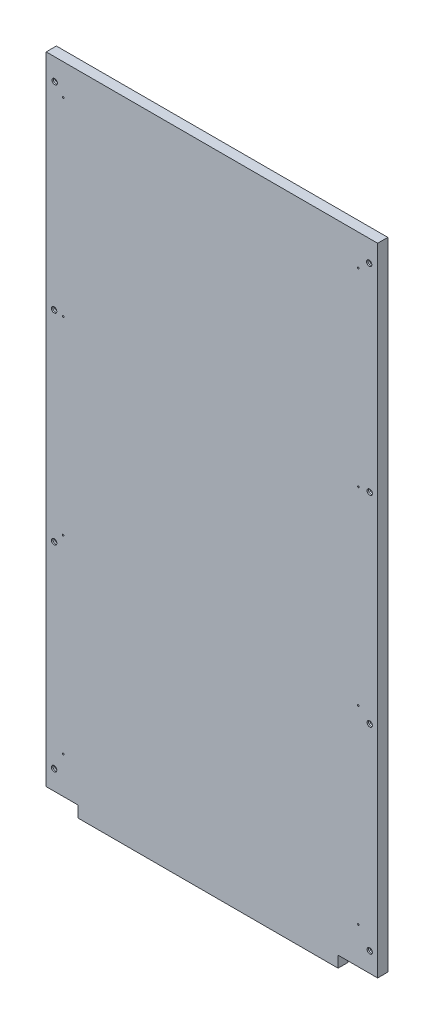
ISO-10303-21;
HEADER;
FILE_DESCRIPTION(('STEP AP214'),'2;1');
FILE_NAME('part.step','',(''),(''),'','','');
FILE_SCHEMA(('AUTOMOTIVE_DESIGN { 1 0 10303 214 1 1 1 1 }'));
ENDSEC;
DATA;
#1=APPLICATION_CONTEXT('core data for automotive mechanical design processes');
#2=APPLICATION_PROTOCOL_DEFINITION('international standard','automotive_design',2000,#1);
#3=PRODUCT_CONTEXT('',#1,'mechanical');
#4=PRODUCT('Part','Part','',(#3));
#5=PRODUCT_RELATED_PRODUCT_CATEGORY('part','',(#4));
#6=PRODUCT_DEFINITION_FORMATION('','',#4);
#7=PRODUCT_DEFINITION_CONTEXT('part definition',#1,'design');
#8=PRODUCT_DEFINITION('design','',#6,#7);
#9=PRODUCT_DEFINITION_SHAPE('','',#8);
#10=(LENGTH_UNIT() NAMED_UNIT(*) SI_UNIT(.MILLI.,.METRE.));
#11=(NAMED_UNIT(*) PLANE_ANGLE_UNIT() SI_UNIT($,.RADIAN.));
#12=(NAMED_UNIT(*) SI_UNIT($,.STERADIAN.) SOLID_ANGLE_UNIT());
#13=UNCERTAINTY_MEASURE_WITH_UNIT(LENGTH_MEASURE(1.E-05),#10,'distance_accuracy_value','');
#14=(GEOMETRIC_REPRESENTATION_CONTEXT(3) GLOBAL_UNCERTAINTY_ASSIGNED_CONTEXT((#13)) GLOBAL_UNIT_ASSIGNED_CONTEXT((#10,
#11,#12)) REPRESENTATION_CONTEXT('',''));
#15=CARTESIAN_POINT('',(0.,0.,0.));
#16=DIRECTION('',(0.,0.,1.));
#17=DIRECTION('',(1.,0.,0.));
#18=AXIS2_PLACEMENT_3D('',#15,#16,#17);
#19=CARTESIAN_POINT('',(-263.,496.922596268,3.));
#20=DIRECTION('',(0.,0.,-1.));
#21=DIRECTION('',(-1.,0.,0.));
#22=AXIS2_PLACEMENT_3D('',#19,#20,#21);
#23=PLANE('',#22);
#24=CARTESIAN_POINT('',(-263.,831.922596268,3.));
#25=DIRECTION('',(0.,0.,-1.));
#26=DIRECTION('',(-1.,0.,0.));
#27=AXIS2_PLACEMENT_3D('',#24,#25,#26);
#28=CIRCLE('',#27,1.5);
#29=CARTESIAN_POINT('',(-264.5,831.922596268,3.));
#30=VERTEX_POINT('',#29);
#31=EDGE_CURVE('E19',#30,#30,#28,.F.);
#32=ORIENTED_EDGE('',*,*,#31,.T.);
#33=EDGE_LOOP('',(#32));
#34=FACE_BOUND('',#33,.T.);
#35=ADVANCED_FACE('F16',(#34),#23,.F.);
#36=CARTESIAN_POINT('',(-263.,496.922596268,3.));
#37=DIRECTION('',(0.,0.,-1.));
#38=DIRECTION('',(-1.,0.,0.));
#39=AXIS2_PLACEMENT_3D('',#36,#37,#38);
#40=PLANE('',#39);
#41=CARTESIAN_POINT('',(-263.,496.922596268,3.));
#42=DIRECTION('',(0.,0.,-1.));
#43=DIRECTION('',(-1.,0.,0.));
#44=AXIS2_PLACEMENT_3D('',#41,#42,#43);
#45=CIRCLE('',#44,1.5);
#46=CARTESIAN_POINT('',(-264.5,496.922596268,3.));
#47=VERTEX_POINT('',#46);
#48=EDGE_CURVE('E240',#47,#47,#45,.F.);
#49=ORIENTED_EDGE('',*,*,#48,.T.);
#50=EDGE_LOOP('',(#49));
#51=FACE_BOUND('',#50,.T.);
#52=ADVANCED_FACE('F478',(#51),#40,.F.);
#53=CARTESIAN_POINT('',(-263.,496.922596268,3.));
#54=DIRECTION('',(0.,0.,-1.));
#55=DIRECTION('',(-1.,0.,0.));
#56=AXIS2_PLACEMENT_3D('',#53,#54,#55);
#57=PLANE('',#56);
#58=CARTESIAN_POINT('',(-263.,1166.92259627,3.));
#59=DIRECTION('',(0.,0.,-1.));
#60=DIRECTION('',(-1.,0.,0.));
#61=AXIS2_PLACEMENT_3D('',#58,#59,#60);
#62=CIRCLE('',#61,1.5);
#63=CARTESIAN_POINT('',(-264.5,1166.92259627,3.));
#64=VERTEX_POINT('',#63);
#65=EDGE_CURVE('E238',#64,#64,#62,.F.);
#66=ORIENTED_EDGE('',*,*,#65,.T.);
#67=EDGE_LOOP('',(#66));
#68=FACE_BOUND('',#67,.T.);
#69=ADVANCED_FACE('F475',(#68),#57,.F.);
#70=CARTESIAN_POINT('',(-263.,496.922596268,3.));
#71=DIRECTION('',(0.,0.,-1.));
#72=DIRECTION('',(-1.,0.,0.));
#73=AXIS2_PLACEMENT_3D('',#70,#71,#72);
#74=PLANE('',#73);
#75=CARTESIAN_POINT('',(-263.,1501.92259627,3.));
#76=DIRECTION('',(0.,0.,-1.));
#77=DIRECTION('',(-1.,0.,0.));
#78=AXIS2_PLACEMENT_3D('',#75,#76,#77);
#79=CIRCLE('',#78,1.5);
#80=CARTESIAN_POINT('',(-264.5,1501.92259627,3.));
#81=VERTEX_POINT('',#80);
#82=EDGE_CURVE('E235',#81,#81,#79,.F.);
#83=ORIENTED_EDGE('',*,*,#82,.T.);
#84=EDGE_LOOP('',(#83));
#85=FACE_BOUND('',#84,.T.);
#86=ADVANCED_FACE('F471',(#85),#74,.F.);
#87=CARTESIAN_POINT('',(-263.,496.922596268,3.));
#88=DIRECTION('',(0.,0.,-1.));
#89=DIRECTION('',(-1.,0.,0.));
#90=AXIS2_PLACEMENT_3D('',#87,#88,#89);
#91=PLANE('',#90);
#92=CARTESIAN_POINT('',(259.,496.922596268,3.));
#93=DIRECTION('',(0.,0.,-1.));
#94=DIRECTION('',(-1.,0.,0.));
#95=AXIS2_PLACEMENT_3D('',#92,#93,#94);
#96=CIRCLE('',#95,1.5);
#97=CARTESIAN_POINT('',(257.5,496.922596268,3.));
#98=VERTEX_POINT('',#97);
#99=EDGE_CURVE('E232',#98,#98,#96,.F.);
#100=ORIENTED_EDGE('',*,*,#99,.T.);
#101=EDGE_LOOP('',(#100));
#102=FACE_BOUND('',#101,.T.);
#103=ADVANCED_FACE('F467',(#102),#91,.F.);
#104=CARTESIAN_POINT('',(-263.,496.922596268,3.));
#105=DIRECTION('',(0.,0.,-1.));
#106=DIRECTION('',(-1.,0.,0.));
#107=AXIS2_PLACEMENT_3D('',#104,#105,#106);
#108=PLANE('',#107);
#109=CARTESIAN_POINT('',(259.,831.922596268,3.));
#110=DIRECTION('',(0.,0.,-1.));
#111=DIRECTION('',(-1.,0.,0.));
#112=AXIS2_PLACEMENT_3D('',#109,#110,#111);
#113=CIRCLE('',#112,1.5);
#114=CARTESIAN_POINT('',(257.5,831.922596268,3.));
#115=VERTEX_POINT('',#114);
#116=EDGE_CURVE('E229',#115,#115,#113,.F.);
#117=ORIENTED_EDGE('',*,*,#116,.T.);
#118=EDGE_LOOP('',(#117));
#119=FACE_BOUND('',#118,.T.);
#120=ADVANCED_FACE('F463',(#119),#108,.F.);
#121=CARTESIAN_POINT('',(-263.,496.922596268,3.));
#122=DIRECTION('',(0.,0.,-1.));
#123=DIRECTION('',(-1.,0.,0.));
#124=AXIS2_PLACEMENT_3D('',#121,#122,#123);
#125=PLANE('',#124);
#126=CARTESIAN_POINT('',(259.,1166.92259627,3.));
#127=DIRECTION('',(0.,0.,-1.));
#128=DIRECTION('',(-1.,0.,0.));
#129=AXIS2_PLACEMENT_3D('',#126,#127,#128);
#130=CIRCLE('',#129,1.5);
#131=CARTESIAN_POINT('',(257.5,1166.92259627,3.));
#132=VERTEX_POINT('',#131);
#133=EDGE_CURVE('E226',#132,#132,#130,.F.);
#134=ORIENTED_EDGE('',*,*,#133,.T.);
#135=EDGE_LOOP('',(#134));
#136=FACE_BOUND('',#135,.T.);
#137=ADVANCED_FACE('F459',(#136),#125,.F.);
#138=CARTESIAN_POINT('',(-263.,496.922596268,3.));
#139=DIRECTION('',(0.,0.,-1.));
#140=DIRECTION('',(-1.,0.,0.));
#141=AXIS2_PLACEMENT_3D('',#138,#139,#140);
#142=PLANE('',#141);
#143=CARTESIAN_POINT('',(259.,1501.92259627,3.));
#144=DIRECTION('',(0.,0.,-1.));
#145=DIRECTION('',(-1.,0.,0.));
#146=AXIS2_PLACEMENT_3D('',#143,#144,#145);
#147=CIRCLE('',#146,1.5);
#148=CARTESIAN_POINT('',(257.5,1501.92259627,3.));
#149=VERTEX_POINT('',#148);
#150=EDGE_CURVE('E223',#149,#149,#147,.F.);
#151=ORIENTED_EDGE('',*,*,#150,.T.);
#152=EDGE_LOOP('',(#151));
#153=FACE_BOUND('',#152,.T.);
#154=ADVANCED_FACE('F252',(#153),#142,.F.);
#155=CARTESIAN_POINT('',(-263.,831.922596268,17.9));
#156=DIRECTION('',(0.,0.,-1.));
#157=DIRECTION('',(-1.,0.,0.));
#158=AXIS2_PLACEMENT_3D('',#155,#156,#157);
#159=CYLINDRICAL_SURFACE('',#158,1.5);
#160=ORIENTED_EDGE('',*,*,#31,.F.);
#161=EDGE_LOOP('',(#160));
#162=FACE_BOUND('',#161,.T.);
#163=CARTESIAN_POINT('',(-263.,831.922596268,18.));
#164=DIRECTION('',(0.,0.,-1.));
#165=DIRECTION('',(-1.,0.,0.));
#166=AXIS2_PLACEMENT_3D('',#163,#164,#165);
#167=CIRCLE('',#166,1.5);
#168=CARTESIAN_POINT('',(-264.5,831.922596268,18.));
#169=VERTEX_POINT('',#168);
#170=EDGE_CURVE('E220',#169,#169,#167,.T.);
#171=ORIENTED_EDGE('',*,*,#170,.F.);
#172=EDGE_LOOP('',(#171));
#173=FACE_BOUND('',#172,.T.);
#174=ADVANCED_FACE('F248',(#162,#173),#159,.F.);
#175=CARTESIAN_POINT('',(-263.,496.922596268,17.9));
#176=DIRECTION('',(0.,0.,-1.));
#177=DIRECTION('',(-1.,0.,0.));
#178=AXIS2_PLACEMENT_3D('',#175,#176,#177);
#179=CYLINDRICAL_SURFACE('',#178,1.5);
#180=ORIENTED_EDGE('',*,*,#48,.F.);
#181=EDGE_LOOP('',(#180));
#182=FACE_BOUND('',#181,.T.);
#183=CARTESIAN_POINT('',(-263.,496.922596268,18.));
#184=DIRECTION('',(0.,0.,-1.));
#185=DIRECTION('',(-1.,0.,0.));
#186=AXIS2_PLACEMENT_3D('',#183,#184,#185);
#187=CIRCLE('',#186,1.5);
#188=CARTESIAN_POINT('',(-264.5,496.922596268,18.));
#189=VERTEX_POINT('',#188);
#190=EDGE_CURVE('E217',#189,#189,#187,.T.);
#191=ORIENTED_EDGE('',*,*,#190,.F.);
#192=EDGE_LOOP('',(#191));
#193=FACE_BOUND('',#192,.T.);
#194=ADVANCED_FACE('F251',(#182,#193),#179,.F.);
#195=CARTESIAN_POINT('',(-263.,1166.92259627,17.9));
#196=DIRECTION('',(0.,0.,-1.));
#197=DIRECTION('',(-1.,0.,0.));
#198=AXIS2_PLACEMENT_3D('',#195,#196,#197);
#199=CYLINDRICAL_SURFACE('',#198,1.5);
#200=ORIENTED_EDGE('',*,*,#65,.F.);
#201=EDGE_LOOP('',(#200));
#202=FACE_BOUND('',#201,.T.);
#203=CARTESIAN_POINT('',(-263.,1166.92259627,18.));
#204=DIRECTION('',(0.,0.,-1.));
#205=DIRECTION('',(-1.,0.,0.));
#206=AXIS2_PLACEMENT_3D('',#203,#204,#205);
#207=CIRCLE('',#206,1.5);
#208=CARTESIAN_POINT('',(-264.5,1166.92259627,18.));
#209=VERTEX_POINT('',#208);
#210=EDGE_CURVE('E190',#209,#209,#207,.T.);
#211=ORIENTED_EDGE('',*,*,#210,.F.);
#212=EDGE_LOOP('',(#211));
#213=FACE_BOUND('',#212,.T.);
#214=ADVANCED_FACE('F446',(#202,#213),#199,.F.);
#215=CARTESIAN_POINT('',(-263.,1501.92259627,17.9));
#216=DIRECTION('',(0.,0.,-1.));
#217=DIRECTION('',(-1.,0.,0.));
#218=AXIS2_PLACEMENT_3D('',#215,#216,#217);
#219=CYLINDRICAL_SURFACE('',#218,1.5);
#220=ORIENTED_EDGE('',*,*,#82,.F.);
#221=EDGE_LOOP('',(#220));
#222=FACE_BOUND('',#221,.T.);
#223=CARTESIAN_POINT('',(-263.,1501.92259627,18.));
#224=DIRECTION('',(0.,0.,-1.));
#225=DIRECTION('',(-1.,0.,0.));
#226=AXIS2_PLACEMENT_3D('',#223,#224,#225);
#227=CIRCLE('',#226,1.5);
#228=CARTESIAN_POINT('',(-264.5,1501.92259627,18.));
#229=VERTEX_POINT('',#228);
#230=EDGE_CURVE('E187',#229,#229,#227,.T.);
#231=ORIENTED_EDGE('',*,*,#230,.F.);
#232=EDGE_LOOP('',(#231));
#233=FACE_BOUND('',#232,.T.);
#234=ADVANCED_FACE('F452',(#222,#233),#219,.F.);
#235=CARTESIAN_POINT('',(259.,496.922596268,17.9));
#236=DIRECTION('',(0.,0.,-1.));
#237=DIRECTION('',(-1.,0.,0.));
#238=AXIS2_PLACEMENT_3D('',#235,#236,#237);
#239=CYLINDRICAL_SURFACE('',#238,1.5);
#240=ORIENTED_EDGE('',*,*,#99,.F.);
#241=EDGE_LOOP('',(#240));
#242=FACE_BOUND('',#241,.T.);
#243=CARTESIAN_POINT('',(259.,496.922596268,18.));
#244=DIRECTION('',(0.,0.,-1.));
#245=DIRECTION('',(-1.,0.,0.));
#246=AXIS2_PLACEMENT_3D('',#243,#244,#245);
#247=CIRCLE('',#246,1.5);
#248=CARTESIAN_POINT('',(257.5,496.922596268,18.));
#249=VERTEX_POINT('',#248);
#250=EDGE_CURVE('E184',#249,#249,#247,.T.);
#251=ORIENTED_EDGE('',*,*,#250,.F.);
#252=EDGE_LOOP('',(#251));
#253=FACE_BOUND('',#252,.T.);
#254=ADVANCED_FACE('F561',(#242,#253),#239,.F.);
#255=CARTESIAN_POINT('',(259.,831.922596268,17.9));
#256=DIRECTION('',(0.,0.,-1.));
#257=DIRECTION('',(-1.,0.,0.));
#258=AXIS2_PLACEMENT_3D('',#255,#256,#257);
#259=CYLINDRICAL_SURFACE('',#258,1.5);
#260=ORIENTED_EDGE('',*,*,#116,.F.);
#261=EDGE_LOOP('',(#260));
#262=FACE_BOUND('',#261,.T.);
#263=CARTESIAN_POINT('',(259.,831.922596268,18.));
#264=DIRECTION('',(0.,0.,-1.));
#265=DIRECTION('',(-1.,0.,0.));
#266=AXIS2_PLACEMENT_3D('',#263,#264,#265);
#267=CIRCLE('',#266,1.5);
#268=CARTESIAN_POINT('',(257.5,831.922596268,18.));
#269=VERTEX_POINT('',#268);
#270=EDGE_CURVE('E181',#269,#269,#267,.T.);
#271=ORIENTED_EDGE('',*,*,#270,.F.);
#272=EDGE_LOOP('',(#271));
#273=FACE_BOUND('',#272,.T.);
#274=ADVANCED_FACE('F570',(#262,#273),#259,.F.);
#275=CARTESIAN_POINT('',(259.,1166.92259627,17.9));
#276=DIRECTION('',(0.,0.,-1.));
#277=DIRECTION('',(-1.,0.,0.));
#278=AXIS2_PLACEMENT_3D('',#275,#276,#277);
#279=CYLINDRICAL_SURFACE('',#278,1.5);
#280=ORIENTED_EDGE('',*,*,#133,.F.);
#281=EDGE_LOOP('',(#280));
#282=FACE_BOUND('',#281,.T.);
#283=CARTESIAN_POINT('',(259.,1166.92259627,18.));
#284=DIRECTION('',(0.,0.,-1.));
#285=DIRECTION('',(-1.,0.,0.));
#286=AXIS2_PLACEMENT_3D('',#283,#284,#285);
#287=CIRCLE('',#286,1.5);
#288=CARTESIAN_POINT('',(257.5,1166.92259627,18.));
#289=VERTEX_POINT('',#288);
#290=EDGE_CURVE('E178',#289,#289,#287,.T.);
#291=ORIENTED_EDGE('',*,*,#290,.F.);
#292=EDGE_LOOP('',(#291));
#293=FACE_BOUND('',#292,.T.);
#294=ADVANCED_FACE('F580',(#282,#293),#279,.F.);
#295=CARTESIAN_POINT('',(259.,1501.92259627,17.9));
#296=DIRECTION('',(0.,0.,-1.));
#297=DIRECTION('',(-1.,0.,0.));
#298=AXIS2_PLACEMENT_3D('',#295,#296,#297);
#299=CYLINDRICAL_SURFACE('',#298,1.5);
#300=ORIENTED_EDGE('',*,*,#150,.F.);
#301=EDGE_LOOP('',(#300));
#302=FACE_BOUND('',#301,.T.);
#303=CARTESIAN_POINT('',(259.,1501.92259627,18.));
#304=DIRECTION('',(0.,0.,-1.));
#305=DIRECTION('',(-1.,0.,0.));
#306=AXIS2_PLACEMENT_3D('',#303,#304,#305);
#307=CIRCLE('',#306,1.5);
#308=CARTESIAN_POINT('',(257.5,1501.92259627,18.));
#309=VERTEX_POINT('',#308);
#310=EDGE_CURVE('E153',#309,#309,#307,.T.);
#311=ORIENTED_EDGE('',*,*,#310,.F.);
#312=EDGE_LOOP('',(#311));
#313=FACE_BOUND('',#312,.T.);
#314=ADVANCED_FACE('F590',(#302,#313),#299,.F.);
#315=CARTESIAN_POINT('',(-278.,1518.92259627,17.9));
#316=DIRECTION('',(0.,0.,-1.));
#317=DIRECTION('',(-1.,0.,0.));
#318=AXIS2_PLACEMENT_3D('',#315,#316,#317);
#319=CYLINDRICAL_SURFACE('',#318,4.75);
#320=CARTESIAN_POINT('',(-278.,1518.92259627,15.4600000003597));
#321=DIRECTION('',(0.,0.,1.));
#322=DIRECTION('',(-0.877582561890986,0.47942553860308,0.));
#323=AXIS2_PLACEMENT_3D('',#320,#321,#322);
#324=CIRCLE('',#323,4.75000000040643);
#325=CARTESIAN_POINT('',(-282.168517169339,1521.19986757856,15.4600000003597));
#326=VERTEX_POINT('',#325);
#327=EDGE_CURVE('E151',#326,#326,#324,.F.);
#328=ORIENTED_EDGE('',*,*,#327,.T.);
#329=EDGE_LOOP('',(#328));
#330=FACE_BOUND('',#329,.T.);
#331=CARTESIAN_POINT('',(-278.,1518.92259627,18.));
#332=DIRECTION('',(0.,0.,-1.));
#333=DIRECTION('',(-1.,0.,0.));
#334=AXIS2_PLACEMENT_3D('',#331,#332,#333);
#335=CIRCLE('',#334,4.75);
#336=CARTESIAN_POINT('',(-282.75,1518.92259627,18.));
#337=VERTEX_POINT('',#336);
#338=EDGE_CURVE('E214',#337,#337,#335,.T.);
#339=ORIENTED_EDGE('',*,*,#338,.F.);
#340=EDGE_LOOP('',(#339));
#341=FACE_BOUND('',#340,.T.);
#342=ADVANCED_FACE('F436',(#330,#341),#319,.F.);
#343=CARTESIAN_POINT('',(-279.,1168.92259627,17.9));
#344=DIRECTION('',(0.,0.,-1.));
#345=DIRECTION('',(-1.,0.,0.));
#346=AXIS2_PLACEMENT_3D('',#343,#344,#345);
#347=CYLINDRICAL_SURFACE('',#346,4.75);
#348=CARTESIAN_POINT('',(-279.,1168.92259627,15.4600000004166));
#349=DIRECTION('',(0.,0.,1.));
#350=DIRECTION('',(-0.877582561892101,0.47942553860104,0.));
#351=AXIS2_PLACEMENT_3D('',#348,#349,#350);
#352=CIRCLE('',#351,4.75000000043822);
#353=CARTESIAN_POINT('',(-283.168517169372,1171.19986757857,15.4600000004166));
#354=VERTEX_POINT('',#353);
#355=EDGE_CURVE('E148',#354,#354,#352,.F.);
#356=ORIENTED_EDGE('',*,*,#355,.T.);
#357=EDGE_LOOP('',(#356));
#358=FACE_BOUND('',#357,.T.);
#359=CARTESIAN_POINT('',(-279.,1168.92259627,18.));
#360=DIRECTION('',(0.,0.,-1.));
#361=DIRECTION('',(-1.,0.,0.));
#362=AXIS2_PLACEMENT_3D('',#359,#360,#361);
#363=CIRCLE('',#362,4.75);
#364=CARTESIAN_POINT('',(-283.75,1168.92259627,18.));
#365=VERTEX_POINT('',#364);
#366=EDGE_CURVE('E211',#365,#365,#363,.T.);
#367=ORIENTED_EDGE('',*,*,#366,.F.);
#368=EDGE_LOOP('',(#367));
#369=FACE_BOUND('',#368,.T.);
#370=ADVANCED_FACE('F432',(#358,#369),#347,.F.);
#371=CARTESIAN_POINT('',(-279.,813.922596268,17.9));
#372=DIRECTION('',(0.,0.,-1.));
#373=DIRECTION('',(-1.,0.,0.));
#374=AXIS2_PLACEMENT_3D('',#371,#372,#373);
#375=CYLINDRICAL_SURFACE('',#374,4.75);
#376=CARTESIAN_POINT('',(-279.,813.922596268,15.4600000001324));
#377=DIRECTION('',(0.,0.,1.));
#378=DIRECTION('',(-0.877582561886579,0.479425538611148,0.));
#379=AXIS2_PLACEMENT_3D('',#376,#377,#378);
#380=CIRCLE('',#379,4.75000000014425);
#381=CARTESIAN_POINT('',(-283.168517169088,816.199867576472,15.4600000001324));
#382=VERTEX_POINT('',#381);
#383=EDGE_CURVE('E145',#382,#382,#380,.F.);
#384=ORIENTED_EDGE('',*,*,#383,.T.);
#385=EDGE_LOOP('',(#384));
#386=FACE_BOUND('',#385,.T.);
#387=CARTESIAN_POINT('',(-279.,813.922596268,18.));
#388=DIRECTION('',(0.,0.,-1.));
#389=DIRECTION('',(-1.,0.,0.));
#390=AXIS2_PLACEMENT_3D('',#387,#388,#389);
#391=CIRCLE('',#390,4.75);
#392=CARTESIAN_POINT('',(-283.75,813.922596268,18.));
#393=VERTEX_POINT('',#392);
#394=EDGE_CURVE('E208',#393,#393,#391,.T.);
#395=ORIENTED_EDGE('',*,*,#394,.F.);
#396=EDGE_LOOP('',(#395));
#397=FACE_BOUND('',#396,.T.);
#398=ADVANCED_FACE('F435',(#386,#397),#375,.F.);
#399=CARTESIAN_POINT('',(-279.,466.422596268,17.9));
#400=DIRECTION('',(0.,0.,-1.));
#401=DIRECTION('',(-1.,0.,0.));
#402=AXIS2_PLACEMENT_3D('',#399,#400,#401);
#403=CYLINDRICAL_SURFACE('',#402,4.75);
#404=CARTESIAN_POINT('',(-279.,466.422596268,15.4600000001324));
#405=DIRECTION('',(0.,0.,1.));
#406=DIRECTION('',(-0.877582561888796,0.479425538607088,0.));
#407=AXIS2_PLACEMENT_3D('',#404,#405,#406);
#408=CIRCLE('',#407,4.75000000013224);
#409=CARTESIAN_POINT('',(-283.168517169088,468.699867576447,15.4600000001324));
#410=VERTEX_POINT('',#409);
#411=EDGE_CURVE('E142',#410,#410,#408,.F.);
#412=ORIENTED_EDGE('',*,*,#411,.T.);
#413=EDGE_LOOP('',(#412));
#414=FACE_BOUND('',#413,.T.);
#415=CARTESIAN_POINT('',(-279.,466.422596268,18.));
#416=DIRECTION('',(0.,0.,-1.));
#417=DIRECTION('',(-1.,0.,0.));
#418=AXIS2_PLACEMENT_3D('',#415,#416,#417);
#419=CIRCLE('',#418,4.75);
#420=CARTESIAN_POINT('',(-283.75,466.422596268,18.));
#421=VERTEX_POINT('',#420);
#422=EDGE_CURVE('E205',#421,#421,#419,.T.);
#423=ORIENTED_EDGE('',*,*,#422,.F.);
#424=EDGE_LOOP('',(#423));
#425=FACE_BOUND('',#424,.T.);
#426=ADVANCED_FACE('F624',(#414,#425),#403,.F.);
#427=CARTESIAN_POINT('',(278.,1518.92259627,17.9));
#428=DIRECTION('',(0.,0.,-1.));
#429=DIRECTION('',(-1.,0.,0.));
#430=AXIS2_PLACEMENT_3D('',#427,#428,#429);
#431=CYLINDRICAL_SURFACE('',#430,4.75);
#432=CARTESIAN_POINT('',(278.,1518.92259627,15.4600000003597));
#433=DIRECTION('',(0.,0.,1.));
#434=DIRECTION('',(0.87758256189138,-0.47942553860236,0.));
#435=AXIS2_PLACEMENT_3D('',#432,#433,#434);
#436=CIRCLE('',#435,4.7500000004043);
#437=CARTESIAN_POINT('',(282.168517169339,1516.64532496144,15.4600000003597));
#438=VERTEX_POINT('',#437);
#439=EDGE_CURVE('E139',#438,#438,#436,.F.);
#440=ORIENTED_EDGE('',*,*,#439,.T.);
#441=EDGE_LOOP('',(#440));
#442=FACE_BOUND('',#441,.T.);
#443=CARTESIAN_POINT('',(278.,1518.92259627,18.));
#444=DIRECTION('',(0.,0.,-1.));
#445=DIRECTION('',(-1.,0.,0.));
#446=AXIS2_PLACEMENT_3D('',#443,#444,#445);
#447=CIRCLE('',#446,4.75);
#448=CARTESIAN_POINT('',(273.25,1518.92259627,18.));
#449=VERTEX_POINT('',#448);
#450=EDGE_CURVE('E202',#449,#449,#447,.T.);
#451=ORIENTED_EDGE('',*,*,#450,.F.);
#452=EDGE_LOOP('',(#451));
#453=FACE_BOUND('',#452,.T.);
#454=ADVANCED_FACE('F634',(#442,#453),#431,.F.);
#455=CARTESIAN_POINT('',(279.,1168.92259627,17.9));
#456=DIRECTION('',(0.,0.,-1.));
#457=DIRECTION('',(-1.,0.,0.));
#458=AXIS2_PLACEMENT_3D('',#455,#456,#457);
#459=CYLINDRICAL_SURFACE('',#458,4.75);
#460=CARTESIAN_POINT('',(279.,1168.92259627,15.4600000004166));
#461=DIRECTION('',(0.,0.,1.));
#462=DIRECTION('',(0.87758256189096,-0.479425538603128,0.));
#463=AXIS2_PLACEMENT_3D('',#460,#461,#462);
#464=CIRCLE('',#463,4.7500000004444);
#465=CARTESIAN_POINT('',(283.168517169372,1166.64532496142,15.4600000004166));
#466=VERTEX_POINT('',#465);
#467=EDGE_CURVE('E136',#466,#466,#464,.F.);
#468=ORIENTED_EDGE('',*,*,#467,.T.);
#469=EDGE_LOOP('',(#468));
#470=FACE_BOUND('',#469,.T.);
#471=CARTESIAN_POINT('',(279.,1168.92259627,18.));
#472=DIRECTION('',(0.,0.,-1.));
#473=DIRECTION('',(-1.,0.,0.));
#474=AXIS2_PLACEMENT_3D('',#471,#472,#473);
#475=CIRCLE('',#474,4.75);
#476=CARTESIAN_POINT('',(274.25,1168.92259627,18.));
#477=VERTEX_POINT('',#476);
#478=EDGE_CURVE('E199',#477,#477,#475,.T.);
#479=ORIENTED_EDGE('',*,*,#478,.F.);
#480=EDGE_LOOP('',(#479));
#481=FACE_BOUND('',#480,.T.);
#482=ADVANCED_FACE('F644',(#470,#481),#459,.F.);
#483=CARTESIAN_POINT('',(279.,813.922596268,17.9));
#484=DIRECTION('',(0.,0.,-1.));
#485=DIRECTION('',(-1.,0.,0.));
#486=AXIS2_PLACEMENT_3D('',#483,#484,#485);
#487=CYLINDRICAL_SURFACE('',#486,4.75);
#488=CARTESIAN_POINT('',(279.,813.922596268,15.459999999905));
#489=DIRECTION('',(0.,0.,1.));
#490=DIRECTION('',(0.877582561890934,-0.479425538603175,0.));
#491=AXIS2_PLACEMENT_3D('',#488,#489,#490);
#492=CIRCLE('',#491,4.74999999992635);
#493=CARTESIAN_POINT('',(283.168517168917,811.64532495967,15.459999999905));
#494=VERTEX_POINT('',#493);
#495=EDGE_CURVE('E133',#494,#494,#492,.F.);
#496=ORIENTED_EDGE('',*,*,#495,.T.);
#497=EDGE_LOOP('',(#496));
#498=FACE_BOUND('',#497,.T.);
#499=CARTESIAN_POINT('',(279.,813.922596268,18.));
#500=DIRECTION('',(0.,0.,-1.));
#501=DIRECTION('',(-1.,0.,0.));
#502=AXIS2_PLACEMENT_3D('',#499,#500,#501);
#503=CIRCLE('',#502,4.75);
#504=CARTESIAN_POINT('',(274.25,813.922596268,18.));
#505=VERTEX_POINT('',#504);
#506=EDGE_CURVE('E196',#505,#505,#503,.T.);
#507=ORIENTED_EDGE('',*,*,#506,.F.);
#508=EDGE_LOOP('',(#507));
#509=FACE_BOUND('',#508,.T.);
#510=ADVANCED_FACE('F269',(#498,#509),#487,.F.);
#511=CARTESIAN_POINT('',(279.,466.422596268,17.9));
#512=DIRECTION('',(0.,0.,-1.));
#513=DIRECTION('',(-1.,0.,0.));
#514=AXIS2_PLACEMENT_3D('',#511,#512,#513);
#515=CYLINDRICAL_SURFACE('',#514,4.75);
#516=CARTESIAN_POINT('',(279.,466.422596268,15.4599999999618));
#517=DIRECTION('',(0.,0.,1.));
#518=DIRECTION('',(0.877582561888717,-0.479425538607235,0.));
#519=AXIS2_PLACEMENT_3D('',#516,#517,#518);
#520=CIRCLE('',#519,4.74999999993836);
#521=CARTESIAN_POINT('',(283.168517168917,464.145324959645,15.4599999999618));
#522=VERTEX_POINT('',#521);
#523=EDGE_CURVE('E97',#522,#522,#520,.F.);
#524=ORIENTED_EDGE('',*,*,#523,.T.);
#525=EDGE_LOOP('',(#524));
#526=FACE_BOUND('',#525,.T.);
#527=CARTESIAN_POINT('',(279.,466.422596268,18.));
#528=DIRECTION('',(0.,0.,-1.));
#529=DIRECTION('',(-1.,0.,0.));
#530=AXIS2_PLACEMENT_3D('',#527,#528,#529);
#531=CIRCLE('',#530,4.75);
#532=CARTESIAN_POINT('',(274.25,466.422596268,18.));
#533=VERTEX_POINT('',#532);
#534=EDGE_CURVE('E193',#533,#533,#531,.T.);
#535=ORIENTED_EDGE('',*,*,#534,.F.);
#536=EDGE_LOOP('',(#535));
#537=FACE_BOUND('',#536,.T.);
#538=ADVANCED_FACE('F258',(#526,#537),#515,.F.);
#539=CARTESIAN_POINT('',(0.,0.,18.));
#540=DIRECTION('',(0.,0.,1.));
#541=DIRECTION('',(1.,0.,0.));
#542=AXIS2_PLACEMENT_3D('',#539,#540,#541);
#543=PLANE('',#542);
#544=ORIENTED_EDGE('',*,*,#310,.T.);
#545=EDGE_LOOP('',(#544));
#546=FACE_BOUND('',#545,.T.);
#547=ORIENTED_EDGE('',*,*,#290,.T.);
#548=EDGE_LOOP('',(#547));
#549=FACE_BOUND('',#548,.T.);
#550=ORIENTED_EDGE('',*,*,#270,.T.);
#551=EDGE_LOOP('',(#550));
#552=FACE_BOUND('',#551,.T.);
#553=ORIENTED_EDGE('',*,*,#250,.T.);
#554=EDGE_LOOP('',(#553));
#555=FACE_BOUND('',#554,.T.);
#556=ORIENTED_EDGE('',*,*,#230,.T.);
#557=EDGE_LOOP('',(#556));
#558=FACE_BOUND('',#557,.T.);
#559=ORIENTED_EDGE('',*,*,#210,.T.);
#560=EDGE_LOOP('',(#559));
#561=FACE_BOUND('',#560,.T.);
#562=ORIENTED_EDGE('',*,*,#534,.T.);
#563=EDGE_LOOP('',(#562));
#564=FACE_BOUND('',#563,.T.);
#565=ORIENTED_EDGE('',*,*,#506,.T.);
#566=EDGE_LOOP('',(#565));
#567=FACE_BOUND('',#566,.T.);
#568=ORIENTED_EDGE('',*,*,#478,.T.);
#569=EDGE_LOOP('',(#568));
#570=FACE_BOUND('',#569,.T.);
#571=ORIENTED_EDGE('',*,*,#450,.T.);
#572=EDGE_LOOP('',(#571));
#573=FACE_BOUND('',#572,.T.);
#574=ORIENTED_EDGE('',*,*,#422,.T.);
#575=EDGE_LOOP('',(#574));
#576=FACE_BOUND('',#575,.T.);
#577=ORIENTED_EDGE('',*,*,#394,.T.);
#578=EDGE_LOOP('',(#577));
#579=FACE_BOUND('',#578,.T.);
#580=ORIENTED_EDGE('',*,*,#366,.T.);
#581=EDGE_LOOP('',(#580));
#582=FACE_BOUND('',#581,.T.);
#583=ORIENTED_EDGE('',*,*,#338,.T.);
#584=EDGE_LOOP('',(#583));
#585=FACE_BOUND('',#584,.T.);
#586=ORIENTED_EDGE('',*,*,#190,.T.);
#587=EDGE_LOOP('',(#586));
#588=FACE_BOUND('',#587,.T.);
#589=ORIENTED_EDGE('',*,*,#170,.T.);
#590=EDGE_LOOP('',(#589));
#591=FACE_BOUND('',#590,.T.);
#592=DIRECTION('',(1.,0.,0.));
#593=VECTOR('',#592,1.);
#594=CARTESIAN_POINT('',(-293.,431.922596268,18.));
#595=LINE('',#594,#593);
#596=CARTESIAN_POINT('',(293.,431.922596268,18.));
#597=VERTEX_POINT('',#596);
#598=CARTESIAN_POINT('',(223.,431.922596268,18.));
#599=VERTEX_POINT('',#598);
#600=EDGE_CURVE('E410',#597,#599,#595,.F.);
#601=ORIENTED_EDGE('',*,*,#600,.F.);
#602=DIRECTION('',(0.,1.,0.));
#603=VECTOR('',#602,1.);
#604=CARTESIAN_POINT('',(293.,1556.92259627,18.));
#605=LINE('',#604,#603);
#606=CARTESIAN_POINT('',(293.,1556.92259627,18.));
#607=VERTEX_POINT('',#606);
#608=EDGE_CURVE('E93',#597,#607,#605,.T.);
#609=ORIENTED_EDGE('',*,*,#608,.T.);
#610=DIRECTION('',(1.,0.,0.));
#611=VECTOR('',#610,1.);
#612=CARTESIAN_POINT('',(-293.,1556.92259627,18.));
#613=LINE('',#612,#611);
#614=CARTESIAN_POINT('',(-293.,1556.92259627,18.));
#615=VERTEX_POINT('',#614);
#616=EDGE_CURVE('E88',#607,#615,#613,.F.);
#617=ORIENTED_EDGE('',*,*,#616,.T.);
#618=DIRECTION('',(0.,1.,0.));
#619=VECTOR('',#618,1.);
#620=CARTESIAN_POINT('',(-293.,431.922596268,18.));
#621=LINE('',#620,#619);
#622=CARTESIAN_POINT('',(-293.,431.922596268,18.));
#623=VERTEX_POINT('',#622);
#624=EDGE_CURVE('E78',#615,#623,#621,.F.);
#625=ORIENTED_EDGE('',*,*,#624,.T.);
#626=DIRECTION('',(1.,0.,0.));
#627=VECTOR('',#626,1.);
#628=CARTESIAN_POINT('',(-293.,431.922596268,18.));
#629=LINE('',#628,#627);
#630=CARTESIAN_POINT('',(-237.,431.922596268,18.));
#631=VERTEX_POINT('',#630);
#632=EDGE_CURVE('E103',#631,#623,#629,.F.);
#633=ORIENTED_EDGE('',*,*,#632,.F.);
#634=DIRECTION('',(0.,1.,0.));
#635=VECTOR('',#634,1.);
#636=CARTESIAN_POINT('',(-237.,431.922596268,18.));
#637=LINE('',#636,#635);
#638=CARTESIAN_POINT('',(-237.,411.922596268,18.));
#639=VERTEX_POINT('',#638);
#640=EDGE_CURVE('E422',#639,#631,#637,.T.);
#641=ORIENTED_EDGE('',*,*,#640,.F.);
#642=DIRECTION('',(1.,0.,0.));
#643=VECTOR('',#642,1.);
#644=CARTESIAN_POINT('',(223.,411.922596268,18.));
#645=LINE('',#644,#643);
#646=CARTESIAN_POINT('',(223.,411.922596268,18.));
#647=VERTEX_POINT('',#646);
#648=EDGE_CURVE('E420',#639,#647,#645,.T.);
#649=ORIENTED_EDGE('',*,*,#648,.T.);
#650=DIRECTION('',(0.,1.,0.));
#651=VECTOR('',#650,1.);
#652=CARTESIAN_POINT('',(223.,411.922596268,18.));
#653=LINE('',#652,#651);
#654=EDGE_CURVE('E414',#599,#647,#653,.F.);
#655=ORIENTED_EDGE('',*,*,#654,.F.);
#656=EDGE_LOOP('',(#601,#609,#617,#625,#633,#641,#649,#655));
#657=FACE_BOUND('',#656,.T.);
#658=ADVANCED_FACE('F92',(#546,#549,#552,#555,#558,#561,#564,#567,#570,#573,#576,#579,#582,#585,
#588,#591,#657),#543,.T.);
#659=CARTESIAN_POINT('',(-278.,1518.92259627,15.4600000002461));
#660=DIRECTION('',(0.,0.,1.));
#661=DIRECTION('',(1.,0.,0.));
#662=AXIS2_PLACEMENT_3D('',#659,#660,#661);
#663=CONICAL_SURFACE('',#662,4.75000000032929,0.78539816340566);
#664=ORIENTED_EDGE('',*,*,#327,.F.);
#665=EDGE_LOOP('',(#664));
#666=FACE_BOUND('',#665,.T.);
#667=CARTESIAN_POINT('',(-278.,1518.92259627,13.91));
#668=DIRECTION('',(0.,0.,-1.));
#669=DIRECTION('',(-1.,0.,0.));
#670=AXIS2_PLACEMENT_3D('',#667,#668,#669);
#671=CIRCLE('',#670,3.2);
#672=CARTESIAN_POINT('',(-281.2,1518.92259627,13.91));
#673=VERTEX_POINT('',#672);
#674=EDGE_CURVE('E128',#673,#673,#671,.T.);
#675=ORIENTED_EDGE('',*,*,#674,.T.);
#676=EDGE_LOOP('',(#675));
#677=FACE_BOUND('',#676,.T.);
#678=ADVANCED_FACE('F257',(#666,#677),#663,.F.);
#679=CARTESIAN_POINT('',(-279.,1168.92259627,15.4600000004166));
#680=DIRECTION('',(0.,0.,1.));
#681=DIRECTION('',(1.,0.,0.));
#682=AXIS2_PLACEMENT_3D('',#679,#680,#681);
#683=CONICAL_SURFACE('',#682,4.75000000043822,0.785398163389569);
#684=ORIENTED_EDGE('',*,*,#355,.F.);
#685=EDGE_LOOP('',(#684));
#686=FACE_BOUND('',#685,.T.);
#687=CARTESIAN_POINT('',(-279.,1168.92259627,13.91));
#688=DIRECTION('',(0.,0.,-1.));
#689=DIRECTION('',(-1.,0.,0.));
#690=AXIS2_PLACEMENT_3D('',#687,#688,#689);
#691=CIRCLE('',#690,3.2);
#692=CARTESIAN_POINT('',(-282.2,1168.92259627,13.91));
#693=VERTEX_POINT('',#692);
#694=EDGE_CURVE('E125',#693,#693,#691,.T.);
#695=ORIENTED_EDGE('',*,*,#694,.T.);
#696=EDGE_LOOP('',(#695));
#697=FACE_BOUND('',#696,.T.);
#698=ADVANCED_FACE('F266',(#686,#697),#683,.F.);
#699=CARTESIAN_POINT('',(-279.,813.922596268,15.4600000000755));
#700=DIRECTION('',(0.,0.,1.));
#701=DIRECTION('',(1.,0.,0.));
#702=AXIS2_PLACEMENT_3D('',#699,#700,#701);
#703=CONICAL_SURFACE('',#702,4.75000000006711,0.785398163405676);
#704=ORIENTED_EDGE('',*,*,#383,.F.);
#705=EDGE_LOOP('',(#704));
#706=FACE_BOUND('',#705,.T.);
#707=CARTESIAN_POINT('',(-279.,813.922596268,13.91));
#708=DIRECTION('',(0.,0.,-1.));
#709=DIRECTION('',(-1.,0.,0.));
#710=AXIS2_PLACEMENT_3D('',#707,#708,#709);
#711=CIRCLE('',#710,3.2);
#712=CARTESIAN_POINT('',(-282.2,813.922596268,13.91));
#713=VERTEX_POINT('',#712);
#714=EDGE_CURVE('E122',#713,#713,#711,.T.);
#715=ORIENTED_EDGE('',*,*,#714,.T.);
#716=EDGE_LOOP('',(#715));
#717=FACE_BOUND('',#716,.T.);
#718=ADVANCED_FACE('F360',(#706,#717),#703,.F.);
#719=CARTESIAN_POINT('',(-279.,466.422596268,15.4600000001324));
#720=DIRECTION('',(0.,0.,1.));
#721=DIRECTION('',(0.,-1.,0.));
#722=AXIS2_PLACEMENT_3D('',#719,#720,#721);
#723=CONICAL_SURFACE('',#722,4.75000000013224,0.785398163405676);
#724=ORIENTED_EDGE('',*,*,#411,.F.);
#725=EDGE_LOOP('',(#724));
#726=FACE_BOUND('',#725,.T.);
#727=CARTESIAN_POINT('',(-279.,466.422596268,13.91));
#728=DIRECTION('',(0.,0.,-1.));
#729=DIRECTION('',(-1.,0.,0.));
#730=AXIS2_PLACEMENT_3D('',#727,#728,#729);
#731=CIRCLE('',#730,3.2);
#732=CARTESIAN_POINT('',(-282.2,466.422596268,13.91));
#733=VERTEX_POINT('',#732);
#734=EDGE_CURVE('E119',#733,#733,#731,.T.);
#735=ORIENTED_EDGE('',*,*,#734,.T.);
#736=EDGE_LOOP('',(#735));
#737=FACE_BOUND('',#736,.T.);
#738=ADVANCED_FACE('F356',(#726,#737),#723,.F.);
#739=CARTESIAN_POINT('',(278.,1518.92259627,15.4600000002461));
#740=DIRECTION('',(0.,0.,1.));
#741=DIRECTION('',(1.,0.,0.));
#742=AXIS2_PLACEMENT_3D('',#739,#740,#741);
#743=CONICAL_SURFACE('',#742,4.75000000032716,0.785398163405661);
#744=ORIENTED_EDGE('',*,*,#439,.F.);
#745=EDGE_LOOP('',(#744));
#746=FACE_BOUND('',#745,.T.);
#747=CARTESIAN_POINT('',(278.,1518.92259627,13.91));
#748=DIRECTION('',(0.,0.,-1.));
#749=DIRECTION('',(-1.,0.,0.));
#750=AXIS2_PLACEMENT_3D('',#747,#748,#749);
#751=CIRCLE('',#750,3.2);
#752=CARTESIAN_POINT('',(274.8,1518.92259627,13.91));
#753=VERTEX_POINT('',#752);
#754=EDGE_CURVE('E116',#753,#753,#751,.T.);
#755=ORIENTED_EDGE('',*,*,#754,.T.);
#756=EDGE_LOOP('',(#755));
#757=FACE_BOUND('',#756,.T.);
#758=ADVANCED_FACE('F352',(#746,#757),#743,.F.);
#759=CARTESIAN_POINT('',(279.,1168.92259627,15.4600000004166));
#760=DIRECTION('',(0.,0.,1.));
#761=DIRECTION('',(1.,0.,0.));
#762=AXIS2_PLACEMENT_3D('',#759,#760,#761);
#763=CONICAL_SURFACE('',#762,4.7500000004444,0.785398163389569);
#764=ORIENTED_EDGE('',*,*,#467,.F.);
#765=EDGE_LOOP('',(#764));
#766=FACE_BOUND('',#765,.T.);
#767=CARTESIAN_POINT('',(279.,1168.92259627,13.91));
#768=DIRECTION('',(0.,0.,-1.));
#769=DIRECTION('',(-1.,0.,0.));
#770=AXIS2_PLACEMENT_3D('',#767,#768,#769);
#771=CIRCLE('',#770,3.2);
#772=CARTESIAN_POINT('',(275.8,1168.92259627,13.91));
#773=VERTEX_POINT('',#772);
#774=EDGE_CURVE('E113',#773,#773,#771,.T.);
#775=ORIENTED_EDGE('',*,*,#774,.T.);
#776=EDGE_LOOP('',(#775));
#777=FACE_BOUND('',#776,.T.);
#778=ADVANCED_FACE('F348',(#766,#777),#763,.F.);
#779=CARTESIAN_POINT('',(279.,813.922596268,15.4599999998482));
#780=DIRECTION('',(0.,0.,1.));
#781=DIRECTION('',(1.,0.,0.));
#782=AXIS2_PLACEMENT_3D('',#779,#780,#781);
#783=CONICAL_SURFACE('',#782,4.74999999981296,0.785398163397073);
#784=ORIENTED_EDGE('',*,*,#495,.F.);
#785=EDGE_LOOP('',(#784));
#786=FACE_BOUND('',#785,.T.);
#787=CARTESIAN_POINT('',(279.,813.922596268,13.91));
#788=DIRECTION('',(0.,0.,-1.));
#789=DIRECTION('',(-1.,0.,0.));
#790=AXIS2_PLACEMENT_3D('',#787,#788,#789);
#791=CIRCLE('',#790,3.2);
#792=CARTESIAN_POINT('',(275.8,813.922596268,13.91));
#793=VERTEX_POINT('',#792);
#794=EDGE_CURVE('E110',#793,#793,#791,.T.);
#795=ORIENTED_EDGE('',*,*,#794,.T.);
#796=EDGE_LOOP('',(#795));
#797=FACE_BOUND('',#796,.T.);
#798=ADVANCED_FACE('F344',(#786,#797),#783,.F.);
#799=CARTESIAN_POINT('',(279.,466.422596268,15.4599999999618));
#800=DIRECTION('',(0.,0.,1.));
#801=DIRECTION('',(0.,-1.,0.));
#802=AXIS2_PLACEMENT_3D('',#799,#800,#801);
#803=CONICAL_SURFACE('',#802,4.74999999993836,0.785398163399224);
#804=ORIENTED_EDGE('',*,*,#523,.F.);
#805=EDGE_LOOP('',(#804));
#806=FACE_BOUND('',#805,.T.);
#807=CARTESIAN_POINT('',(279.,466.422596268,13.91));
#808=DIRECTION('',(0.,0.,-1.));
#809=DIRECTION('',(-1.,0.,0.));
#810=AXIS2_PLACEMENT_3D('',#807,#808,#809);
#811=CIRCLE('',#810,3.2);
#812=CARTESIAN_POINT('',(275.8,466.422596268,13.91));
#813=VERTEX_POINT('',#812);
#814=EDGE_CURVE('E107',#813,#813,#811,.T.);
#815=ORIENTED_EDGE('',*,*,#814,.T.);
#816=EDGE_LOOP('',(#815));
#817=FACE_BOUND('',#816,.T.);
#818=ADVANCED_FACE('F341',(#806,#817),#803,.F.);
#819=CARTESIAN_POINT('',(-293.,1556.92259627,0.));
#820=DIRECTION('',(0.,-1.,0.));
#821=DIRECTION('',(0.,0.,-1.));
#822=AXIS2_PLACEMENT_3D('',#819,#820,#821);
#823=PLANE('',#822);
#824=DIRECTION('',(1.,0.,0.));
#825=VECTOR('',#824,1.);
#826=CARTESIAN_POINT('',(0.,1556.92259627,0.));
#827=LINE('',#826,#825);
#828=CARTESIAN_POINT('',(293.,1556.92259627,0.));
#829=VERTEX_POINT('',#828);
#830=CARTESIAN_POINT('',(-293.,1556.92259627,0.));
#831=VERTEX_POINT('',#830);
#832=EDGE_CURVE('E101',#829,#831,#827,.F.);
#833=ORIENTED_EDGE('',*,*,#832,.T.);
#834=DIRECTION('',(0.,0.,-1.));
#835=VECTOR('',#834,1.);
#836=CARTESIAN_POINT('',(-293.,1556.92259627,0.));
#837=LINE('',#836,#835);
#838=EDGE_CURVE('E85',#831,#615,#837,.F.);
#839=ORIENTED_EDGE('',*,*,#838,.T.);
#840=ORIENTED_EDGE('',*,*,#616,.F.);
#841=DIRECTION('',(0.,0.,1.));
#842=VECTOR('',#841,1.);
#843=CARTESIAN_POINT('',(293.,1556.92259627,0.));
#844=LINE('',#843,#842);
#845=EDGE_CURVE('E407',#607,#829,#844,.F.);
#846=ORIENTED_EDGE('',*,*,#845,.T.);
#847=EDGE_LOOP('',(#833,#839,#840,#846));
#848=FACE_BOUND('',#847,.T.);
#849=ADVANCED_FACE('F100',(#848),#823,.F.);
#850=CARTESIAN_POINT('',(-293.,431.922596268,0.));
#851=DIRECTION('',(1.,0.,0.));
#852=DIRECTION('',(0.,0.,-1.));
#853=AXIS2_PLACEMENT_3D('',#850,#851,#852);
#854=PLANE('',#853);
#855=DIRECTION('',(0.,1.,0.));
#856=VECTOR('',#855,1.);
#857=CARTESIAN_POINT('',(-293.,0.,0.));
#858=LINE('',#857,#856);
#859=CARTESIAN_POINT('',(-293.,431.922596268,0.));
#860=VERTEX_POINT('',#859);
#861=EDGE_CURVE('E403',#831,#860,#858,.F.);
#862=ORIENTED_EDGE('',*,*,#861,.T.);
#863=DIRECTION('',(0.,0.,-1.));
#864=VECTOR('',#863,1.);
#865=CARTESIAN_POINT('',(-293.,431.922596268,0.));
#866=LINE('',#865,#864);
#867=EDGE_CURVE('E87',#623,#860,#866,.T.);
#868=ORIENTED_EDGE('',*,*,#867,.F.);
#869=ORIENTED_EDGE('',*,*,#624,.F.);
#870=ORIENTED_EDGE('',*,*,#838,.F.);
#871=EDGE_LOOP('',(#862,#868,#869,#870));
#872=FACE_BOUND('',#871,.T.);
#873=ADVANCED_FACE('F83',(#872),#854,.F.);
#874=CARTESIAN_POINT('',(-293.,431.922596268,0.));
#875=DIRECTION('',(0.,-1.,0.));
#876=DIRECTION('',(0.,0.,-1.));
#877=AXIS2_PLACEMENT_3D('',#874,#875,#876);
#878=PLANE('',#877);
#879=DIRECTION('',(0.,0.,1.));
#880=VECTOR('',#879,1.);
#881=CARTESIAN_POINT('',(-237.,431.922596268,0.));
#882=LINE('',#881,#880);
#883=CARTESIAN_POINT('',(-237.,431.922596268,0.));
#884=VERTEX_POINT('',#883);
#885=EDGE_CURVE('E425',#631,#884,#882,.F.);
#886=ORIENTED_EDGE('',*,*,#885,.F.);
#887=ORIENTED_EDGE('',*,*,#632,.T.);
#888=ORIENTED_EDGE('',*,*,#867,.T.);
#889=DIRECTION('',(1.,0.,0.));
#890=VECTOR('',#889,1.);
#891=CARTESIAN_POINT('',(0.,431.922596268,0.));
#892=LINE('',#891,#890);
#893=EDGE_CURVE('E400',#860,#884,#892,.T.);
#894=ORIENTED_EDGE('',*,*,#893,.T.);
#895=EDGE_LOOP('',(#886,#887,#888,#894));
#896=FACE_BOUND('',#895,.T.);
#897=ADVANCED_FACE('F332',(#896),#878,.T.);
#898=CARTESIAN_POINT('',(-237.,431.922596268,0.));
#899=DIRECTION('',(-1.,0.,0.));
#900=DIRECTION('',(0.,0.,1.));
#901=AXIS2_PLACEMENT_3D('',#898,#899,#900);
#902=PLANE('',#901);
#903=DIRECTION('',(0.,0.,1.));
#904=VECTOR('',#903,1.);
#905=CARTESIAN_POINT('',(-237.,411.922596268,0.));
#906=LINE('',#905,#904);
#907=CARTESIAN_POINT('',(-237.,411.922596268,0.));
#908=VERTEX_POINT('',#907);
#909=EDGE_CURVE('E417',#908,#639,#906,.T.);
#910=ORIENTED_EDGE('',*,*,#909,.T.);
#911=ORIENTED_EDGE('',*,*,#640,.T.);
#912=ORIENTED_EDGE('',*,*,#885,.T.);
#913=DIRECTION('',(0.,1.,0.));
#914=VECTOR('',#913,1.);
#915=CARTESIAN_POINT('',(-237.,0.,0.));
#916=LINE('',#915,#914);
#917=EDGE_CURVE('E394',#884,#908,#916,.F.);
#918=ORIENTED_EDGE('',*,*,#917,.T.);
#919=EDGE_LOOP('',(#910,#911,#912,#918));
#920=FACE_BOUND('',#919,.T.);
#921=ADVANCED_FACE('F328',(#920),#902,.T.);
#922=CARTESIAN_POINT('',(223.,411.922596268,0.));
#923=DIRECTION('',(0.,1.,0.));
#924=DIRECTION('',(0.,0.,1.));
#925=AXIS2_PLACEMENT_3D('',#922,#923,#924);
#926=PLANE('',#925);
#927=DIRECTION('',(1.,0.,0.));
#928=VECTOR('',#927,1.);
#929=CARTESIAN_POINT('',(0.,411.922596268,0.));
#930=LINE('',#929,#928);
#931=CARTESIAN_POINT('',(223.,411.922596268,0.));
#932=VERTEX_POINT('',#931);
#933=EDGE_CURVE('E392',#908,#932,#930,.T.);
#934=ORIENTED_EDGE('',*,*,#933,.T.);
#935=DIRECTION('',(0.,0.,-1.));
#936=VECTOR('',#935,1.);
#937=CARTESIAN_POINT('',(223.,411.922596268,0.));
#938=LINE('',#937,#936);
#939=EDGE_CURVE('E391',#647,#932,#938,.T.);
#940=ORIENTED_EDGE('',*,*,#939,.F.);
#941=ORIENTED_EDGE('',*,*,#648,.F.);
#942=ORIENTED_EDGE('',*,*,#909,.F.);
#943=EDGE_LOOP('',(#934,#940,#941,#942));
#944=FACE_BOUND('',#943,.T.);
#945=ADVANCED_FACE('F324',(#944),#926,.F.);
#946=CARTESIAN_POINT('',(223.,411.922596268,0.));
#947=DIRECTION('',(1.,0.,0.));
#948=DIRECTION('',(0.,0.,-1.));
#949=AXIS2_PLACEMENT_3D('',#946,#947,#948);
#950=PLANE('',#949);
#951=DIRECTION('',(0.,0.,-1.));
#952=VECTOR('',#951,1.);
#953=CARTESIAN_POINT('',(223.,431.922596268,0.));
#954=LINE('',#953,#952);
#955=CARTESIAN_POINT('',(223.,431.922596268,0.));
#956=VERTEX_POINT('',#955);
#957=EDGE_CURVE('E389',#599,#956,#954,.T.);
#958=ORIENTED_EDGE('',*,*,#957,.F.);
#959=ORIENTED_EDGE('',*,*,#654,.T.);
#960=ORIENTED_EDGE('',*,*,#939,.T.);
#961=DIRECTION('',(0.,1.,0.));
#962=VECTOR('',#961,1.);
#963=CARTESIAN_POINT('',(223.,0.,0.));
#964=LINE('',#963,#962);
#965=EDGE_CURVE('E384',#932,#956,#964,.T.);
#966=ORIENTED_EDGE('',*,*,#965,.T.);
#967=EDGE_LOOP('',(#958,#959,#960,#966));
#968=FACE_BOUND('',#967,.T.);
#969=ADVANCED_FACE('F320',(#968),#950,.T.);
#970=CARTESIAN_POINT('',(-293.,431.922596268,0.));
#971=DIRECTION('',(0.,-1.,0.));
#972=DIRECTION('',(0.,0.,-1.));
#973=AXIS2_PLACEMENT_3D('',#970,#971,#972);
#974=PLANE('',#973);
#975=DIRECTION('',(0.,0.,1.));
#976=VECTOR('',#975,1.);
#977=CARTESIAN_POINT('',(293.,431.922596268,0.));
#978=LINE('',#977,#976);
#979=CARTESIAN_POINT('',(293.,431.922596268,0.));
#980=VERTEX_POINT('',#979);
#981=EDGE_CURVE('E34',#980,#597,#978,.T.);
#982=ORIENTED_EDGE('',*,*,#981,.T.);
#983=ORIENTED_EDGE('',*,*,#600,.T.);
#984=ORIENTED_EDGE('',*,*,#957,.T.);
#985=DIRECTION('',(1.,0.,0.));
#986=VECTOR('',#985,1.);
#987=CARTESIAN_POINT('',(0.,431.922596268,0.));
#988=LINE('',#987,#986);
#989=EDGE_CURVE('E381',#956,#980,#988,.T.);
#990=ORIENTED_EDGE('',*,*,#989,.T.);
#991=EDGE_LOOP('',(#982,#983,#984,#990));
#992=FACE_BOUND('',#991,.T.);
#993=ADVANCED_FACE('F317',(#992),#974,.T.);
#994=CARTESIAN_POINT('',(293.,1556.92259627,0.));
#995=DIRECTION('',(-1.,0.,0.));
#996=DIRECTION('',(0.,0.,1.));
#997=AXIS2_PLACEMENT_3D('',#994,#995,#996);
#998=PLANE('',#997);
#999=DIRECTION('',(0.,1.,0.));
#1000=VECTOR('',#999,1.);
#1001=CARTESIAN_POINT('',(293.,0.,0.));
#1002=LINE('',#1001,#1000);
#1003=EDGE_CURVE('E175',#980,#829,#1002,.T.);
#1004=ORIENTED_EDGE('',*,*,#1003,.T.);
#1005=ORIENTED_EDGE('',*,*,#845,.F.);
#1006=ORIENTED_EDGE('',*,*,#608,.F.);
#1007=ORIENTED_EDGE('',*,*,#981,.F.);
#1008=EDGE_LOOP('',(#1004,#1005,#1006,#1007));
#1009=FACE_BOUND('',#1008,.T.);
#1010=ADVANCED_FACE('F313',(#1009),#998,.F.);
#1011=CARTESIAN_POINT('',(-278.,1518.92259627,17.9));
#1012=DIRECTION('',(0.,0.,-1.));
#1013=DIRECTION('',(-1.,0.,0.));
#1014=AXIS2_PLACEMENT_3D('',#1011,#1012,#1013);
#1015=CYLINDRICAL_SURFACE('',#1014,3.2);
#1016=ORIENTED_EDGE('',*,*,#674,.F.);
#1017=EDGE_LOOP('',(#1016));
#1018=FACE_BOUND('',#1017,.T.);
#1019=CARTESIAN_POINT('',(-278.,1518.92259627,0.));
#1020=DIRECTION('',(0.,0.,-1.));
#1021=DIRECTION('',(-1.,0.,0.));
#1022=AXIS2_PLACEMENT_3D('',#1019,#1020,#1021);
#1023=CIRCLE('',#1022,3.2);
#1024=CARTESIAN_POINT('',(-281.2,1518.92259627,0.));
#1025=VERTEX_POINT('',#1024);
#1026=EDGE_CURVE('E172',#1025,#1025,#1023,.T.);
#1027=ORIENTED_EDGE('',*,*,#1026,.T.);
#1028=EDGE_LOOP('',(#1027));
#1029=FACE_BOUND('',#1028,.T.);
#1030=ADVANCED_FACE('F309',(#1018,#1029),#1015,.F.);
#1031=CARTESIAN_POINT('',(-279.,1168.92259627,17.9));
#1032=DIRECTION('',(0.,0.,-1.));
#1033=DIRECTION('',(-1.,0.,0.));
#1034=AXIS2_PLACEMENT_3D('',#1031,#1032,#1033);
#1035=CYLINDRICAL_SURFACE('',#1034,3.2);
#1036=ORIENTED_EDGE('',*,*,#694,.F.);
#1037=EDGE_LOOP('',(#1036));
#1038=FACE_BOUND('',#1037,.T.);
#1039=CARTESIAN_POINT('',(-279.,1168.92259627,0.));
#1040=DIRECTION('',(0.,0.,-1.));
#1041=DIRECTION('',(-1.,0.,0.));
#1042=AXIS2_PLACEMENT_3D('',#1039,#1040,#1041);
#1043=CIRCLE('',#1042,3.2);
#1044=CARTESIAN_POINT('',(-282.2,1168.92259627,0.));
#1045=VERTEX_POINT('',#1044);
#1046=EDGE_CURVE('E169',#1045,#1045,#1043,.T.);
#1047=ORIENTED_EDGE('',*,*,#1046,.T.);
#1048=EDGE_LOOP('',(#1047));
#1049=FACE_BOUND('',#1048,.T.);
#1050=ADVANCED_FACE('F305',(#1038,#1049),#1035,.F.);
#1051=CARTESIAN_POINT('',(-279.,813.922596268,17.9));
#1052=DIRECTION('',(0.,0.,-1.));
#1053=DIRECTION('',(-1.,0.,0.));
#1054=AXIS2_PLACEMENT_3D('',#1051,#1052,#1053);
#1055=CYLINDRICAL_SURFACE('',#1054,3.2);
#1056=ORIENTED_EDGE('',*,*,#714,.F.);
#1057=EDGE_LOOP('',(#1056));
#1058=FACE_BOUND('',#1057,.T.);
#1059=CARTESIAN_POINT('',(-279.,813.922596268,0.));
#1060=DIRECTION('',(0.,0.,-1.));
#1061=DIRECTION('',(-1.,0.,0.));
#1062=AXIS2_PLACEMENT_3D('',#1059,#1060,#1061);
#1063=CIRCLE('',#1062,3.2);
#1064=CARTESIAN_POINT('',(-282.2,813.922596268,0.));
#1065=VERTEX_POINT('',#1064);
#1066=EDGE_CURVE('E166',#1065,#1065,#1063,.T.);
#1067=ORIENTED_EDGE('',*,*,#1066,.T.);
#1068=EDGE_LOOP('',(#1067));
#1069=FACE_BOUND('',#1068,.T.);
#1070=ADVANCED_FACE('F301',(#1058,#1069),#1055,.F.);
#1071=CARTESIAN_POINT('',(-279.,466.422596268,17.9));
#1072=DIRECTION('',(0.,0.,-1.));
#1073=DIRECTION('',(-1.,0.,0.));
#1074=AXIS2_PLACEMENT_3D('',#1071,#1072,#1073);
#1075=CYLINDRICAL_SURFACE('',#1074,3.2);
#1076=ORIENTED_EDGE('',*,*,#734,.F.);
#1077=EDGE_LOOP('',(#1076));
#1078=FACE_BOUND('',#1077,.T.);
#1079=CARTESIAN_POINT('',(-279.,466.422596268,0.));
#1080=DIRECTION('',(0.,0.,-1.));
#1081=DIRECTION('',(-1.,0.,0.));
#1082=AXIS2_PLACEMENT_3D('',#1079,#1080,#1081);
#1083=CIRCLE('',#1082,3.2);
#1084=CARTESIAN_POINT('',(-282.2,466.422596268,0.));
#1085=VERTEX_POINT('',#1084);
#1086=EDGE_CURVE('E163',#1085,#1085,#1083,.T.);
#1087=ORIENTED_EDGE('',*,*,#1086,.T.);
#1088=EDGE_LOOP('',(#1087));
#1089=FACE_BOUND('',#1088,.T.);
#1090=ADVANCED_FACE('F297',(#1078,#1089),#1075,.F.);
#1091=CARTESIAN_POINT('',(278.,1518.92259627,17.9));
#1092=DIRECTION('',(0.,0.,-1.));
#1093=DIRECTION('',(-1.,0.,0.));
#1094=AXIS2_PLACEMENT_3D('',#1091,#1092,#1093);
#1095=CYLINDRICAL_SURFACE('',#1094,3.2);
#1096=ORIENTED_EDGE('',*,*,#754,.F.);
#1097=EDGE_LOOP('',(#1096));
#1098=FACE_BOUND('',#1097,.T.);
#1099=CARTESIAN_POINT('',(278.,1518.92259627,0.));
#1100=DIRECTION('',(0.,0.,-1.));
#1101=DIRECTION('',(-1.,0.,0.));
#1102=AXIS2_PLACEMENT_3D('',#1099,#1100,#1101);
#1103=CIRCLE('',#1102,3.2);
#1104=CARTESIAN_POINT('',(274.8,1518.92259627,0.));
#1105=VERTEX_POINT('',#1104);
#1106=EDGE_CURVE('E160',#1105,#1105,#1103,.T.);
#1107=ORIENTED_EDGE('',*,*,#1106,.T.);
#1108=EDGE_LOOP('',(#1107));
#1109=FACE_BOUND('',#1108,.T.);
#1110=ADVANCED_FACE('F293',(#1098,#1109),#1095,.F.);
#1111=CARTESIAN_POINT('',(279.,1168.92259627,17.9));
#1112=DIRECTION('',(0.,0.,-1.));
#1113=DIRECTION('',(-1.,0.,0.));
#1114=AXIS2_PLACEMENT_3D('',#1111,#1112,#1113);
#1115=CYLINDRICAL_SURFACE('',#1114,3.2);
#1116=ORIENTED_EDGE('',*,*,#774,.F.);
#1117=EDGE_LOOP('',(#1116));
#1118=FACE_BOUND('',#1117,.T.);
#1119=CARTESIAN_POINT('',(279.,1168.92259627,0.));
#1120=DIRECTION('',(0.,0.,-1.));
#1121=DIRECTION('',(-1.,0.,0.));
#1122=AXIS2_PLACEMENT_3D('',#1119,#1120,#1121);
#1123=CIRCLE('',#1122,3.2);
#1124=CARTESIAN_POINT('',(275.8,1168.92259627,0.));
#1125=VERTEX_POINT('',#1124);
#1126=EDGE_CURVE('E157',#1125,#1125,#1123,.T.);
#1127=ORIENTED_EDGE('',*,*,#1126,.T.);
#1128=EDGE_LOOP('',(#1127));
#1129=FACE_BOUND('',#1128,.T.);
#1130=ADVANCED_FACE('F289',(#1118,#1129),#1115,.F.);
#1131=CARTESIAN_POINT('',(279.,813.922596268,17.9));
#1132=DIRECTION('',(0.,0.,-1.));
#1133=DIRECTION('',(-1.,0.,0.));
#1134=AXIS2_PLACEMENT_3D('',#1131,#1132,#1133);
#1135=CYLINDRICAL_SURFACE('',#1134,3.2);
#1136=ORIENTED_EDGE('',*,*,#794,.F.);
#1137=EDGE_LOOP('',(#1136));
#1138=FACE_BOUND('',#1137,.T.);
#1139=CARTESIAN_POINT('',(279.,813.922596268,0.));
#1140=DIRECTION('',(0.,0.,-1.));
#1141=DIRECTION('',(-1.,0.,0.));
#1142=AXIS2_PLACEMENT_3D('',#1139,#1140,#1141);
#1143=CIRCLE('',#1142,3.2);
#1144=CARTESIAN_POINT('',(275.8,813.922596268,0.));
#1145=VERTEX_POINT('',#1144);
#1146=EDGE_CURVE('E25',#1145,#1145,#1143,.T.);
#1147=ORIENTED_EDGE('',*,*,#1146,.T.);
#1148=EDGE_LOOP('',(#1147));
#1149=FACE_BOUND('',#1148,.T.);
#1150=ADVANCED_FACE('F281',(#1138,#1149),#1135,.F.);
#1151=CARTESIAN_POINT('',(279.,466.422596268,17.9));
#1152=DIRECTION('',(0.,0.,-1.));
#1153=DIRECTION('',(-1.,0.,0.));
#1154=AXIS2_PLACEMENT_3D('',#1151,#1152,#1153);
#1155=CYLINDRICAL_SURFACE('',#1154,3.2);
#1156=ORIENTED_EDGE('',*,*,#814,.F.);
#1157=EDGE_LOOP('',(#1156));
#1158=FACE_BOUND('',#1157,.T.);
#1159=CARTESIAN_POINT('',(279.,466.422596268,0.));
#1160=DIRECTION('',(0.,0.,-1.));
#1161=DIRECTION('',(-1.,0.,0.));
#1162=AXIS2_PLACEMENT_3D('',#1159,#1160,#1161);
#1163=CIRCLE('',#1162,3.2);
#1164=CARTESIAN_POINT('',(275.8,466.422596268,0.));
#1165=VERTEX_POINT('',#1164);
#1166=EDGE_CURVE('E11',#1165,#1165,#1163,.T.);
#1167=ORIENTED_EDGE('',*,*,#1166,.T.);
#1168=EDGE_LOOP('',(#1167));
#1169=FACE_BOUND('',#1168,.T.);
#1170=ADVANCED_FACE('F275',(#1158,#1169),#1155,.F.);
#1171=CARTESIAN_POINT('',(0.,0.,0.));
#1172=DIRECTION('',(0.,0.,1.));
#1173=DIRECTION('',(1.,0.,0.));
#1174=AXIS2_PLACEMENT_3D('',#1171,#1172,#1173);
#1175=PLANE('',#1174);
#1176=ORIENTED_EDGE('',*,*,#1166,.F.);
#1177=EDGE_LOOP('',(#1176));
#1178=FACE_BOUND('',#1177,.T.);
#1179=ORIENTED_EDGE('',*,*,#1146,.F.);
#1180=EDGE_LOOP('',(#1179));
#1181=FACE_BOUND('',#1180,.T.);
#1182=ORIENTED_EDGE('',*,*,#1126,.F.);
#1183=EDGE_LOOP('',(#1182));
#1184=FACE_BOUND('',#1183,.T.);
#1185=ORIENTED_EDGE('',*,*,#1106,.F.);
#1186=EDGE_LOOP('',(#1185));
#1187=FACE_BOUND('',#1186,.T.);
#1188=ORIENTED_EDGE('',*,*,#1086,.F.);
#1189=EDGE_LOOP('',(#1188));
#1190=FACE_BOUND('',#1189,.T.);
#1191=ORIENTED_EDGE('',*,*,#1066,.F.);
#1192=EDGE_LOOP('',(#1191));
#1193=FACE_BOUND('',#1192,.T.);
#1194=ORIENTED_EDGE('',*,*,#1046,.F.);
#1195=EDGE_LOOP('',(#1194));
#1196=FACE_BOUND('',#1195,.T.);
#1197=ORIENTED_EDGE('',*,*,#1026,.F.);
#1198=EDGE_LOOP('',(#1197));
#1199=FACE_BOUND('',#1198,.T.);
#1200=ORIENTED_EDGE('',*,*,#989,.F.);
#1201=ORIENTED_EDGE('',*,*,#965,.F.);
#1202=ORIENTED_EDGE('',*,*,#933,.F.);
#1203=ORIENTED_EDGE('',*,*,#917,.F.);
#1204=ORIENTED_EDGE('',*,*,#893,.F.);
#1205=ORIENTED_EDGE('',*,*,#861,.F.);
#1206=ORIENTED_EDGE('',*,*,#832,.F.);
#1207=ORIENTED_EDGE('',*,*,#1003,.F.);
#1208=EDGE_LOOP('',(#1200,#1201,#1202,#1203,#1204,#1205,#1206,#1207));
#1209=FACE_BOUND('',#1208,.T.);
#1210=ADVANCED_FACE('F273',(#1178,#1181,#1184,#1187,#1190,#1193,#1196,#1199,#1209),#1175,.F.);
#1211=CLOSED_SHELL('',(#35,#52,#69,#86,#103,#120,#137,#154,#174,#194,#214,#234,#254,#274,#294,
#314,#342,#370,#398,#426,#454,#482,#510,#538,#658,#678,#698,#718,#738,#758,#778,#798,#818,#849,
#873,#897,#921,#945,#969,#993,#1010,#1030,#1050,#1070,#1090,#1110,#1130,#1150,#1170,#1210));
#1212=MANIFOLD_SOLID_BREP('B1',#1211);
#1213=ADVANCED_BREP_SHAPE_REPRESENTATION('',(#18,#1212),#14);
#1214=SHAPE_DEFINITION_REPRESENTATION(#9,#1213);
ENDSEC;
END-ISO-10303-21;
